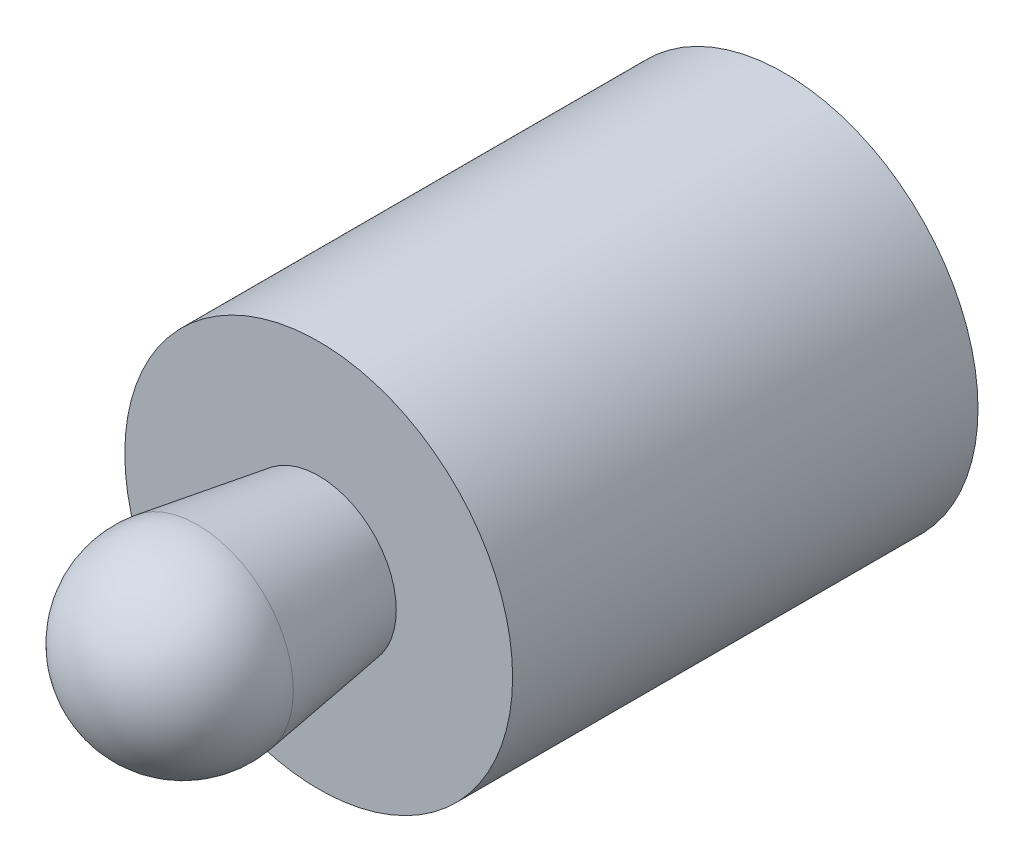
ISO-10303-21;
HEADER;
FILE_DESCRIPTION(('STEP AP214'),'2;1');
FILE_NAME('part.step','',(''),(''),'','','');
FILE_SCHEMA(('AUTOMOTIVE_DESIGN { 1 0 10303 214 1 1 1 1 }'));
ENDSEC;
DATA;
#1=APPLICATION_CONTEXT('core data for automotive mechanical design processes');
#2=APPLICATION_PROTOCOL_DEFINITION('international standard','automotive_design',2000,#1);
#3=PRODUCT_CONTEXT('',#1,'mechanical');
#4=PRODUCT('Part','Part','',(#3));
#5=PRODUCT_RELATED_PRODUCT_CATEGORY('part','',(#4));
#6=PRODUCT_DEFINITION_FORMATION('','',#4);
#7=PRODUCT_DEFINITION_CONTEXT('part definition',#1,'design');
#8=PRODUCT_DEFINITION('design','',#6,#7);
#9=PRODUCT_DEFINITION_SHAPE('','',#8);
#10=(LENGTH_UNIT() NAMED_UNIT(*) SI_UNIT(.MILLI.,.METRE.));
#11=(NAMED_UNIT(*) PLANE_ANGLE_UNIT() SI_UNIT($,.RADIAN.));
#12=(NAMED_UNIT(*) SI_UNIT($,.STERADIAN.) SOLID_ANGLE_UNIT());
#13=UNCERTAINTY_MEASURE_WITH_UNIT(LENGTH_MEASURE(1.E-05),#10,'distance_accuracy_value','');
#14=(GEOMETRIC_REPRESENTATION_CONTEXT(3) GLOBAL_UNCERTAINTY_ASSIGNED_CONTEXT((#13)) GLOBAL_UNIT_ASSIGNED_CONTEXT((#10,
#11,#12)) REPRESENTATION_CONTEXT('',''));
#15=CARTESIAN_POINT('',(0.,0.,0.));
#16=DIRECTION('',(0.,0.,1.));
#17=DIRECTION('',(1.,0.,0.));
#18=AXIS2_PLACEMENT_3D('',#15,#16,#17);
#19=CARTESIAN_POINT('',(0.,0.,0.));
#20=DIRECTION('',(0.,0.,1.));
#21=DIRECTION('',(1.,0.,0.));
#22=AXIS2_PLACEMENT_3D('',#19,#20,#21);
#23=PLANE('',#22);
#24=CARTESIAN_POINT('',(0.,0.,0.));
#25=DIRECTION('',(0.,0.,1.));
#26=DIRECTION('',(1.,0.,0.));
#27=AXIS2_PLACEMENT_3D('',#24,#25,#26);
#28=CIRCLE('',#27,5.);
#29=CARTESIAN_POINT('',(5.,0.,0.));
#30=VERTEX_POINT('',#29);
#31=EDGE_CURVE('E8',#30,#30,#28,.T.);
#32=ORIENTED_EDGE('',*,*,#31,.F.);
#33=EDGE_LOOP('',(#32));
#34=FACE_BOUND('',#33,.T.);
#35=ADVANCED_FACE('F12',(#34),#23,.F.);
#36=CARTESIAN_POINT('',(0.,0.,20.));
#37=DIRECTION('',(0.,0.,1.));
#38=DIRECTION('',(1.,0.,0.));
#39=AXIS2_PLACEMENT_3D('',#36,#37,#38);
#40=CYLINDRICAL_SURFACE('',#39,5.);
#41=CARTESIAN_POINT('',(0.,0.,12.));
#42=DIRECTION('',(0.,0.,1.));
#43=DIRECTION('',(1.,0.,0.));
#44=AXIS2_PLACEMENT_3D('',#41,#42,#43);
#45=CIRCLE('',#44,5.);
#46=CARTESIAN_POINT('',(5.,0.,12.));
#47=VERTEX_POINT('',#46);
#48=EDGE_CURVE('E18',#47,#47,#45,.T.);
#49=ORIENTED_EDGE('',*,*,#48,.F.);
#50=EDGE_LOOP('',(#49));
#51=FACE_BOUND('',#50,.T.);
#52=ORIENTED_EDGE('',*,*,#31,.T.);
#53=EDGE_LOOP('',(#52));
#54=FACE_BOUND('',#53,.T.);
#55=ADVANCED_FACE('F45',(#51,#54),#40,.T.);
#56=CARTESIAN_POINT('',(-2.,0.,12.));
#57=DIRECTION('',(0.,0.,1.));
#58=DIRECTION('',(1.,0.,0.));
#59=AXIS2_PLACEMENT_3D('',#56,#57,#58);
#60=PLANE('',#59);
#61=ORIENTED_EDGE('',*,*,#48,.T.);
#62=EDGE_LOOP('',(#61));
#63=FACE_BOUND('',#62,.T.);
#64=CARTESIAN_POINT('',(0.,0.,12.));
#65=DIRECTION('',(0.,0.,1.));
#66=DIRECTION('',(1.,0.,0.));
#67=AXIS2_PLACEMENT_3D('',#64,#65,#66);
#68=CIRCLE('',#67,2.);
#69=CARTESIAN_POINT('',(2.,0.,12.));
#70=VERTEX_POINT('',#69);
#71=EDGE_CURVE('E22',#70,#70,#68,.T.);
#72=ORIENTED_EDGE('',*,*,#71,.F.);
#73=EDGE_LOOP('',(#72));
#74=FACE_BOUND('',#73,.T.);
#75=ADVANCED_FACE('F36',(#63,#74),#60,.T.);
#76=CARTESIAN_POINT('',(0.,0.,15.1268546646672));
#77=DIRECTION('',(0.,0.,1.));
#78=DIRECTION('',(1.,0.,0.));
#79=AXIS2_PLACEMENT_3D('',#76,#77,#78);
#80=CONICAL_SURFACE('',#79,2.47199566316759,0.149817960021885);
#81=ORIENTED_EDGE('',*,*,#71,.T.);
#82=EDGE_LOOP('',(#81));
#83=FACE_BOUND('',#82,.T.);
#84=CARTESIAN_POINT('',(0.,0.,15.1268546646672));
#85=DIRECTION('',(0.,0.,1.));
#86=DIRECTION('',(1.,0.,0.));
#87=AXIS2_PLACEMENT_3D('',#84,#85,#86);
#88=CIRCLE('',#87,2.47199566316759);
#89=CARTESIAN_POINT('',(2.47199566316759,0.,15.1268546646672));
#90=VERTEX_POINT('',#89);
#91=EDGE_CURVE('E26',#90,#90,#88,.T.);
#92=ORIENTED_EDGE('',*,*,#91,.F.);
#93=EDGE_LOOP('',(#92));
#94=FACE_BOUND('',#93,.T.);
#95=ADVANCED_FACE('F34',(#83,#94),#80,.T.);
#96=CARTESIAN_POINT('',(0.,0.,15.5));
#97=DIRECTION('',(0.,0.,1.));
#98=DIRECTION('',(1.,0.,0.));
#99=AXIS2_PLACEMENT_3D('',#96,#97,#98);
#100=SPHERICAL_SURFACE('',#99,2.5);
#101=ORIENTED_EDGE('',*,*,#91,.T.);
#102=EDGE_LOOP('',(#101));
#103=FACE_BOUND('',#102,.T.);
#104=ADVANCED_FACE('F32',(#103),#100,.T.);
#105=CLOSED_SHELL('',(#35,#55,#75,#95,#104));
#106=MANIFOLD_SOLID_BREP('B1',#105);
#107=ADVANCED_BREP_SHAPE_REPRESENTATION('',(#18,#106),#14);
#108=SHAPE_DEFINITION_REPRESENTATION(#9,#107);
ENDSEC;
END-ISO-10303-21;
